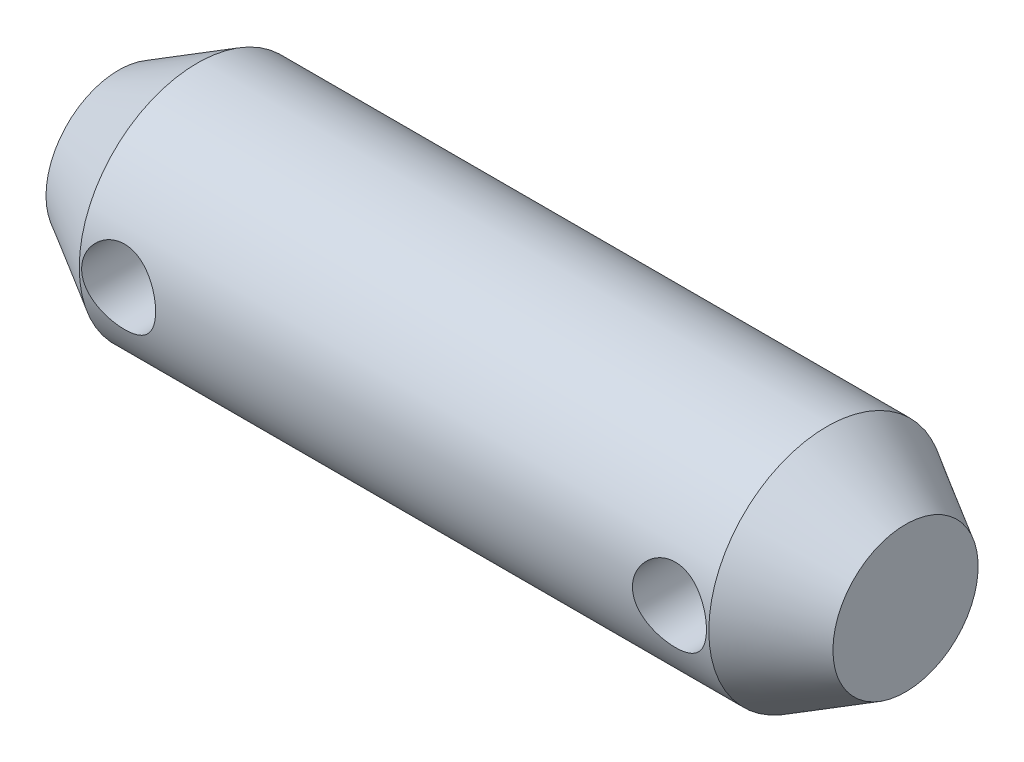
ISO-10303-21;
HEADER;
FILE_DESCRIPTION(('STEP AP214'),'2;1');
FILE_NAME('part.step','',(''),(''),'','','');
FILE_SCHEMA(('AUTOMOTIVE_DESIGN { 1 0 10303 214 1 1 1 1 }'));
ENDSEC;
DATA;
#1=APPLICATION_CONTEXT('core data for automotive mechanical design processes');
#2=APPLICATION_PROTOCOL_DEFINITION('international standard','automotive_design',2000,#1);
#3=PRODUCT_CONTEXT('',#1,'mechanical');
#4=PRODUCT('Part','Part','',(#3));
#5=PRODUCT_RELATED_PRODUCT_CATEGORY('part','',(#4));
#6=PRODUCT_DEFINITION_FORMATION('','',#4);
#7=PRODUCT_DEFINITION_CONTEXT('part definition',#1,'design');
#8=PRODUCT_DEFINITION('design','',#6,#7);
#9=PRODUCT_DEFINITION_SHAPE('','',#8);
#10=(LENGTH_UNIT() NAMED_UNIT(*) SI_UNIT(.MILLI.,.METRE.));
#11=(NAMED_UNIT(*) PLANE_ANGLE_UNIT() SI_UNIT($,.RADIAN.));
#12=(NAMED_UNIT(*) SI_UNIT($,.STERADIAN.) SOLID_ANGLE_UNIT());
#13=UNCERTAINTY_MEASURE_WITH_UNIT(LENGTH_MEASURE(1.E-05),#10,'distance_accuracy_value','');
#14=(GEOMETRIC_REPRESENTATION_CONTEXT(3) GLOBAL_UNCERTAINTY_ASSIGNED_CONTEXT((#13)) GLOBAL_UNIT_ASSIGNED_CONTEXT((#10,
#11,#12)) REPRESENTATION_CONTEXT('',''));
#15=CARTESIAN_POINT('',(0.,0.,0.));
#16=DIRECTION('',(0.,0.,1.));
#17=DIRECTION('',(1.,0.,0.));
#18=AXIS2_PLACEMENT_3D('',#15,#16,#17);
#19=CARTESIAN_POINT('',(0.,0.922649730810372,0.));
#20=DIRECTION('',(1.,0.,0.));
#21=DIRECTION('',(0.,0.,-1.));
#22=AXIS2_PLACEMENT_3D('',#19,#20,#21);
#23=PLANE('',#22);
#24=CARTESIAN_POINT('',(0.,0.,0.));
#25=DIRECTION('',(-1.,0.,0.));
#26=DIRECTION('',(0.,0.,1.));
#27=AXIS2_PLACEMENT_3D('',#24,#25,#26);
#28=CIRCLE('',#27,0.922649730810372);
#29=CARTESIAN_POINT('',(0.,0.,0.922649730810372));
#30=VERTEX_POINT('',#29);
#31=EDGE_CURVE('E86',#30,#30,#28,.T.);
#32=ORIENTED_EDGE('',*,*,#31,.T.);
#33=EDGE_LOOP('',(#32));
#34=FACE_BOUND('',#33,.T.);
#35=ADVANCED_FACE('F37',(#34),#23,.F.);
#36=CARTESIAN_POINT('',(1.,0.,0.));
#37=DIRECTION('',(1.,0.,0.));
#38=DIRECTION('',(0.,0.,-1.));
#39=AXIS2_PLACEMENT_3D('',#36,#37,#38);
#40=CONICAL_SURFACE('',#39,1.5,0.523598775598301);
#41=ORIENTED_EDGE('',*,*,#31,.F.);
#42=EDGE_LOOP('',(#41));
#43=FACE_BOUND('',#42,.T.);
#44=CARTESIAN_POINT('',(1.,0.,0.));
#45=DIRECTION('',(-1.,0.,0.));
#46=DIRECTION('',(0.,0.,1.));
#47=AXIS2_PLACEMENT_3D('',#44,#45,#46);
#48=CIRCLE('',#47,1.5);
#49=CARTESIAN_POINT('',(1.,0.,1.5));
#50=VERTEX_POINT('',#49);
#51=EDGE_CURVE('E89',#50,#50,#48,.T.);
#52=ORIENTED_EDGE('',*,*,#51,.T.);
#53=EDGE_LOOP('',(#52));
#54=FACE_BOUND('',#53,.T.);
#55=ADVANCED_FACE('F108',(#43,#54),#40,.T.);
#56=CARTESIAN_POINT('',(-13.7357999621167,0.,0.));
#57=DIRECTION('',(-1.,0.,0.));
#58=DIRECTION('',(0.,0.,1.));
#59=AXIS2_PLACEMENT_3D('',#56,#57,#58);
#60=CYLINDRICAL_SURFACE('',#59,1.5);
#61=CARTESIAN_POINT('',(1.97,0.,-1.5));
#62=CARTESIAN_POINT('',(1.96999984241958,0.0257296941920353,-1.49999987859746));
#63=CARTESIAN_POINT('',(1.96788022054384,0.0514610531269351,-1.4993317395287));
#64=CARTESIAN_POINT('',(1.95948010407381,0.102171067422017,-1.49673187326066));
#65=CARTESIAN_POINT('',(1.95319868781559,0.127149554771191,-1.49479986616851));
#66=CARTESIAN_POINT('',(1.93670775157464,0.175615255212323,-1.48988327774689));
#67=CARTESIAN_POINT('',(1.92650433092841,0.199104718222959,-1.48690033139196));
#68=CARTESIAN_POINT('',(1.90248503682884,0.24403930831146,-1.4801897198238));
#69=CARTESIAN_POINT('',(1.88866858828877,0.265484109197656,-1.47646193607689));
#70=CARTESIAN_POINT('',(1.85736415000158,0.306386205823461,-1.46852782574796));
#71=CARTESIAN_POINT('',(1.83978429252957,0.325771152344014,-1.46431103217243));
#72=CARTESIAN_POINT('',(1.80164765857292,0.361371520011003,-1.45593466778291));
#73=CARTESIAN_POINT('',(1.78109032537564,0.377586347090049,-1.45177510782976));
#74=CARTESIAN_POINT('',(1.73695498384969,0.406779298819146,-1.44387174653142));
#75=CARTESIAN_POINT('',(1.71331456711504,0.419666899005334,-1.44014085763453));
#76=CARTESIAN_POINT('',(1.66406613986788,0.441253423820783,-1.43367475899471));
#77=CARTESIAN_POINT('',(1.63845865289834,0.44995345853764,-1.4309392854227));
#78=CARTESIAN_POINT('',(1.58681965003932,0.462652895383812,-1.426883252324));
#79=CARTESIAN_POINT('',(1.56082440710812,0.466786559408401,-1.42552238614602));
#80=CARTESIAN_POINT('',(1.50847648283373,0.470655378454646,-1.42424999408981));
#81=CARTESIAN_POINT('',(1.48212389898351,0.47039170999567,-1.42433808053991));
#82=CARTESIAN_POINT('',(1.43092127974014,0.46557832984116,-1.4259180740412));
#83=CARTESIAN_POINT('',(1.40605316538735,0.461199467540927,-1.42735401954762));
#84=CARTESIAN_POINT('',(1.35742403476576,0.448557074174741,-1.43137699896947));
#85=CARTESIAN_POINT('',(1.33366313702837,0.440293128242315,-1.43396415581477));
#86=CARTESIAN_POINT('',(1.28751665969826,0.419994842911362,-1.44004082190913));
#87=CARTESIAN_POINT('',(1.26515636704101,0.407906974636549,-1.44354301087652));
#88=CARTESIAN_POINT('',(1.22272558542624,0.380341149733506,-1.45104934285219));
#89=CARTESIAN_POINT('',(1.20265569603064,0.364862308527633,-1.45505361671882));
#90=CARTESIAN_POINT('',(1.16440977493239,0.33011625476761,-1.4633372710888));
#91=CARTESIAN_POINT('',(1.14636250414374,0.310708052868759,-1.46762085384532));
#92=CARTESIAN_POINT('',(1.11374744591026,0.269087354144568,-1.47581884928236));
#93=CARTESIAN_POINT('',(1.09917991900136,0.246874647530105,-1.47973323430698));
#94=CARTESIAN_POINT('',(1.07384999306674,0.200026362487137,-1.48679327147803));
#95=CARTESIAN_POINT('',(1.06311845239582,0.175373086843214,-1.48993262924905));
#96=CARTESIAN_POINT('',(1.04599313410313,0.124489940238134,-1.49504344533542));
#97=CARTESIAN_POINT('',(1.03959803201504,0.0982605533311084,-1.49701526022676));
#98=CARTESIAN_POINT('',(1.03154680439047,0.046062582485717,-1.4995113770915));
#99=CARTESIAN_POINT('',(1.02971638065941,0.0201233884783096,-1.50008889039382));
#100=CARTESIAN_POINT('',(1.0303548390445,-0.0316943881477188,-1.49988879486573));
#101=CARTESIAN_POINT('',(1.03282308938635,-0.0575729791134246,-1.49911138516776));
#102=CARTESIAN_POINT('',(1.04184898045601,-0.10786167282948,-1.49632376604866));
#103=CARTESIAN_POINT('',(1.04830278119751,-0.132292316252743,-1.49434488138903));
#104=CARTESIAN_POINT('',(1.0649897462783,-0.179717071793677,-1.48938602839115));
#105=CARTESIAN_POINT('',(1.07522337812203,-0.202711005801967,-1.48640593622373));
#106=CARTESIAN_POINT('',(1.09945926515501,-0.247235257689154,-1.47966025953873));
#107=CARTESIAN_POINT('',(1.1135475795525,-0.268716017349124,-1.4758772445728));
#108=CARTESIAN_POINT('',(1.14498975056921,-0.309066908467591,-1.46795816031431));
#109=CARTESIAN_POINT('',(1.16234449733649,-0.327936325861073,-1.46382199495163));
#110=CARTESIAN_POINT('',(1.20064671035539,-0.363309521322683,-1.45545526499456));
#111=CARTESIAN_POINT('',(1.2217097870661,-0.379689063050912,-1.45122750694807));
#112=CARTESIAN_POINT('',(1.26637744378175,-0.408692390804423,-1.44332853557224));
#113=CARTESIAN_POINT('',(1.28998198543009,-0.421316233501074,-1.43965731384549));
#114=CARTESIAN_POINT('',(1.33901578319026,-0.442371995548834,-1.43332765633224));
#115=CARTESIAN_POINT('',(1.364437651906,-0.450819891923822,-1.43066536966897));
#116=CARTESIAN_POINT('',(1.41644365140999,-0.46328458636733,-1.42667832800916));
#117=CARTESIAN_POINT('',(1.44302733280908,-0.467303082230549,-1.42535306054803));
#118=CARTESIAN_POINT('',(1.49530302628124,-0.470672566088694,-1.42424370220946));
#119=CARTESIAN_POINT('',(1.52098062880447,-0.470227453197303,-1.42439228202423));
#120=CARTESIAN_POINT('',(1.5718759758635,-0.465174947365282,-1.42605020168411));
#121=CARTESIAN_POINT('',(1.5970937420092,-0.460567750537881,-1.42755947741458));
#122=CARTESIAN_POINT('',(1.6459868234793,-0.447458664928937,-1.43172156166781));
#123=CARTESIAN_POINT('',(1.66967944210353,-0.439015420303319,-1.43435711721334));
#124=CARTESIAN_POINT('',(1.71533064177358,-0.418520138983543,-1.44047031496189));
#125=CARTESIAN_POINT('',(1.73728886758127,-0.406467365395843,-1.44394812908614));
#126=CARTESIAN_POINT('',(1.77978222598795,-0.378541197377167,-1.45152451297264));
#127=CARTESIAN_POINT('',(1.80022750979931,-0.362536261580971,-1.45564210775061));
#128=CARTESIAN_POINT('',(1.83820815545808,-0.32739119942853,-1.46394692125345));
#129=CARTESIAN_POINT('',(1.85574273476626,-0.308250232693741,-1.46813415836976));
#130=CARTESIAN_POINT('',(1.88798171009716,-0.266619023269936,-1.4762716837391));
#131=CARTESIAN_POINT('',(1.90257405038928,-0.244039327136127,-1.48020964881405));
#132=CARTESIAN_POINT('',(1.92773659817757,-0.196624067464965,-1.48724983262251));
#133=CARTESIAN_POINT('',(1.93830836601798,-0.171789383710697,-1.49035237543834));
#134=CARTESIAN_POINT('',(1.95437431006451,-0.122697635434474,-1.49515962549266));
#135=CARTESIAN_POINT('',(1.96021699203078,-0.0985636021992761,-1.49695895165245));
#136=CARTESIAN_POINT('',(1.96802951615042,-0.0496201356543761,-1.4993790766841));
#137=CARTESIAN_POINT('',(1.97000015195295,-0.0248108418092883,-1.50000011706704));
#138=CARTESIAN_POINT('',(1.97,0.,-1.5));
#139=B_SPLINE_CURVE_WITH_KNOTS('',3,(#61,#62,#63,#64,#65,#66,#67,#68,#69,#70,#71,#72,#73,#74,
#75,#76,#77,#78,#79,#80,#81,#82,#83,#84,#85,#86,#87,#88,#89,#90,#91,#92,#93,#94,#95,#96,#97,#98,
#99,#100,#101,#102,#103,#104,#105,#106,#107,#108,#109,#110,#111,#112,#113,#114,#115,#116,#117,
#118,#119,#120,#121,#122,#123,#124,#125,#126,#127,#128,#129,#130,#131,#132,#133,#134,#135,#136,
#137,#138),.UNSPECIFIED.,.T.,.F.,(4,2,2,2,2,2,2,2,2,2,2,2,2,2,2,2,2,2,2,2,2,2,2,2,2,2,2,2,2,2,2,
2,2,2,2,2,2,2,4),(0.,0.0770978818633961,0.154212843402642,0.231208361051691,0.308216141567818,
0.38737739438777,0.466553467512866,0.547698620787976,0.628822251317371,0.707491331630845,
0.786139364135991,0.86165999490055,0.937188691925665,1.0138253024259,1.09048192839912,
1.17064784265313,1.25081975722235,1.3316228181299,1.41240118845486,1.49004434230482,
1.56767608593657,1.64336588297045,1.719065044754,1.79661583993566,1.87418779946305,
1.95485101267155,2.03551300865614,2.11586395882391,2.19618409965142,2.2728525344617,
2.34951735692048,2.42504766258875,2.50059339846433,2.57910824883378,2.65764417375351,
2.73876320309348,2.81985071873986,2.89421054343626,2.96855512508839),.UNSPECIFIED.);
#140=CARTESIAN_POINT('',(1.97,0.,-1.5));
#141=VERTEX_POINT('',#140);
#142=EDGE_CURVE('E10',#141,#141,#139,.T.);
#143=ORIENTED_EDGE('',*,*,#142,.T.);
#144=EDGE_LOOP('',(#143));
#145=FACE_BOUND('',#144,.T.);
#146=CARTESIAN_POINT('',(1.97,0.,1.5));
#147=CARTESIAN_POINT('',(1.96999984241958,-0.0257296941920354,1.49999987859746));
#148=CARTESIAN_POINT('',(1.96788022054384,-0.0514610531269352,1.4993317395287));
#149=CARTESIAN_POINT('',(1.95948010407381,-0.102171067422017,1.49673187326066));
#150=CARTESIAN_POINT('',(1.95319868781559,-0.127149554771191,1.49479986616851));
#151=CARTESIAN_POINT('',(1.93670775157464,-0.175615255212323,1.48988327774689));
#152=CARTESIAN_POINT('',(1.92650433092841,-0.199104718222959,1.48690033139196));
#153=CARTESIAN_POINT('',(1.90248503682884,-0.24403930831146,1.4801897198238));
#154=CARTESIAN_POINT('',(1.88866858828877,-0.265484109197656,1.47646193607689));
#155=CARTESIAN_POINT('',(1.85736415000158,-0.306386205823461,1.46852782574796));
#156=CARTESIAN_POINT('',(1.83978429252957,-0.325771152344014,1.46431103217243));
#157=CARTESIAN_POINT('',(1.80164765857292,-0.361371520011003,1.45593466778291));
#158=CARTESIAN_POINT('',(1.78109032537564,-0.377586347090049,1.45177510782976));
#159=CARTESIAN_POINT('',(1.73695498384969,-0.406779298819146,1.44387174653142));
#160=CARTESIAN_POINT('',(1.71331456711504,-0.419666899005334,1.44014085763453));
#161=CARTESIAN_POINT('',(1.66406613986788,-0.441253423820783,1.43367475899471));
#162=CARTESIAN_POINT('',(1.63845865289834,-0.44995345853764,1.4309392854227));
#163=CARTESIAN_POINT('',(1.58681965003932,-0.462652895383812,1.426883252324));
#164=CARTESIAN_POINT('',(1.56082440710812,-0.466786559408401,1.42552238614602));
#165=CARTESIAN_POINT('',(1.50847648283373,-0.470655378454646,1.42424999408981));
#166=CARTESIAN_POINT('',(1.48212389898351,-0.47039170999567,1.42433808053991));
#167=CARTESIAN_POINT('',(1.43092127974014,-0.46557832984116,1.4259180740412));
#168=CARTESIAN_POINT('',(1.40605316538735,-0.461199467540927,1.42735401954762));
#169=CARTESIAN_POINT('',(1.35742403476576,-0.448557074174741,1.43137699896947));
#170=CARTESIAN_POINT('',(1.33366313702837,-0.440293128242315,1.43396415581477));
#171=CARTESIAN_POINT('',(1.28751665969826,-0.419994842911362,1.44004082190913));
#172=CARTESIAN_POINT('',(1.26515636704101,-0.407906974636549,1.44354301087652));
#173=CARTESIAN_POINT('',(1.22272558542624,-0.380341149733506,1.45104934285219));
#174=CARTESIAN_POINT('',(1.20265569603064,-0.364862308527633,1.45505361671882));
#175=CARTESIAN_POINT('',(1.16440977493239,-0.33011625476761,1.4633372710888));
#176=CARTESIAN_POINT('',(1.14636250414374,-0.310708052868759,1.46762085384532));
#177=CARTESIAN_POINT('',(1.11374744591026,-0.269087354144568,1.47581884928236));
#178=CARTESIAN_POINT('',(1.09917991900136,-0.246874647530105,1.47973323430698));
#179=CARTESIAN_POINT('',(1.07384999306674,-0.200026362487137,1.48679327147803));
#180=CARTESIAN_POINT('',(1.06311845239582,-0.175373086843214,1.48993262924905));
#181=CARTESIAN_POINT('',(1.04599313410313,-0.124489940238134,1.49504344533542));
#182=CARTESIAN_POINT('',(1.03959803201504,-0.0982605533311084,1.49701526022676));
#183=CARTESIAN_POINT('',(1.03154680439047,-0.046062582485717,1.4995113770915));
#184=CARTESIAN_POINT('',(1.02971638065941,-0.0201233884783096,1.50008889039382));
#185=CARTESIAN_POINT('',(1.0303548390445,0.0316943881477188,1.49988879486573));
#186=CARTESIAN_POINT('',(1.03282308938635,0.0575729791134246,1.49911138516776));
#187=CARTESIAN_POINT('',(1.04184898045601,0.10786167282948,1.49632376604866));
#188=CARTESIAN_POINT('',(1.04830278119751,0.132292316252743,1.49434488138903));
#189=CARTESIAN_POINT('',(1.0649897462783,0.179717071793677,1.48938602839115));
#190=CARTESIAN_POINT('',(1.07522337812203,0.202711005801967,1.48640593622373));
#191=CARTESIAN_POINT('',(1.09945926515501,0.247235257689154,1.47966025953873));
#192=CARTESIAN_POINT('',(1.1135475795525,0.268716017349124,1.4758772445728));
#193=CARTESIAN_POINT('',(1.14498975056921,0.309066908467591,1.46795816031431));
#194=CARTESIAN_POINT('',(1.16234449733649,0.327936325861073,1.46382199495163));
#195=CARTESIAN_POINT('',(1.20064671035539,0.363309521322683,1.45545526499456));
#196=CARTESIAN_POINT('',(1.2217097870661,0.379689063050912,1.45122750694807));
#197=CARTESIAN_POINT('',(1.26637744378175,0.408692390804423,1.44332853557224));
#198=CARTESIAN_POINT('',(1.28998198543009,0.421316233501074,1.43965731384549));
#199=CARTESIAN_POINT('',(1.33901578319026,0.442371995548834,1.43332765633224));
#200=CARTESIAN_POINT('',(1.364437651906,0.450819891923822,1.43066536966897));
#201=CARTESIAN_POINT('',(1.41644365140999,0.46328458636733,1.42667832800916));
#202=CARTESIAN_POINT('',(1.44302733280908,0.467303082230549,1.42535306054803));
#203=CARTESIAN_POINT('',(1.49530302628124,0.470672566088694,1.42424370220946));
#204=CARTESIAN_POINT('',(1.52098062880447,0.470227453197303,1.42439228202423));
#205=CARTESIAN_POINT('',(1.5718759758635,0.465174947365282,1.42605020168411));
#206=CARTESIAN_POINT('',(1.5970937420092,0.460567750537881,1.42755947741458));
#207=CARTESIAN_POINT('',(1.6459868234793,0.447458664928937,1.43172156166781));
#208=CARTESIAN_POINT('',(1.66967944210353,0.439015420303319,1.43435711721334));
#209=CARTESIAN_POINT('',(1.71533064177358,0.418520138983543,1.44047031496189));
#210=CARTESIAN_POINT('',(1.73728886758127,0.406467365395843,1.44394812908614));
#211=CARTESIAN_POINT('',(1.77978222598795,0.378541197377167,1.45152451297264));
#212=CARTESIAN_POINT('',(1.80022750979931,0.362536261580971,1.45564210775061));
#213=CARTESIAN_POINT('',(1.83820815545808,0.32739119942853,1.46394692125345));
#214=CARTESIAN_POINT('',(1.85574273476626,0.308250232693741,1.46813415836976));
#215=CARTESIAN_POINT('',(1.88798171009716,0.266619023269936,1.4762716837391));
#216=CARTESIAN_POINT('',(1.90257405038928,0.244039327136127,1.48020964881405));
#217=CARTESIAN_POINT('',(1.92773659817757,0.196624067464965,1.48724983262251));
#218=CARTESIAN_POINT('',(1.93830836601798,0.171789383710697,1.49035237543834));
#219=CARTESIAN_POINT('',(1.95437431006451,0.122697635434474,1.49515962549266));
#220=CARTESIAN_POINT('',(1.96021699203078,0.0985636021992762,1.49695895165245));
#221=CARTESIAN_POINT('',(1.96802951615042,0.0496201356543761,1.4993790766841));
#222=CARTESIAN_POINT('',(1.97000015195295,0.0248108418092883,1.50000011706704));
#223=CARTESIAN_POINT('',(1.97,0.,1.5));
#224=B_SPLINE_CURVE_WITH_KNOTS('',3,(#146,#147,#148,#149,#150,#151,#152,#153,#154,#155,#156,
#157,#158,#159,#160,#161,#162,#163,#164,#165,#166,#167,#168,#169,#170,#171,#172,#173,#174,#175,
#176,#177,#178,#179,#180,#181,#182,#183,#184,#185,#186,#187,#188,#189,#190,#191,#192,#193,#194,
#195,#196,#197,#198,#199,#200,#201,#202,#203,#204,#205,#206,#207,#208,#209,#210,#211,#212,#213,
#214,#215,#216,#217,#218,#219,#220,#221,#222,#223),.UNSPECIFIED.,.T.,.F.,(4,2,2,2,2,2,2,2,2,2,2,
2,2,2,2,2,2,2,2,2,2,2,2,2,2,2,2,2,2,2,2,2,2,2,2,2,2,2,4),(0.,0.0770978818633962,
0.154212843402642,0.231208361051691,0.308216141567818,0.38737739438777,0.466553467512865,
0.547698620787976,0.628822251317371,0.707491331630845,0.786139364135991,0.86165999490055,
0.937188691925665,1.0138253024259,1.09048192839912,1.17064784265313,1.25081975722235,
1.3316228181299,1.41240118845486,1.49004434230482,1.56767608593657,1.64336588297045,
1.719065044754,1.79661583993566,1.87418779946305,1.95485101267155,2.03551300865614,
2.11586395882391,2.19618409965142,2.2728525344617,2.34951735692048,2.42504766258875,
2.50059339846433,2.57910824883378,2.65764417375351,2.73876320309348,2.81985071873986,
2.89421054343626,2.96855512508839),.UNSPECIFIED.);
#225=CARTESIAN_POINT('',(1.97,0.,1.5));
#226=VERTEX_POINT('',#225);
#227=EDGE_CURVE('E48',#226,#226,#224,.T.);
#228=ORIENTED_EDGE('',*,*,#227,.T.);
#229=EDGE_LOOP('',(#228));
#230=FACE_BOUND('',#229,.T.);
#231=CARTESIAN_POINT('',(8.97,0.,-1.5));
#232=CARTESIAN_POINT('',(8.96999984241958,0.0257296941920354,-1.49999987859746));
#233=CARTESIAN_POINT('',(8.96788022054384,0.0514610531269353,-1.4993317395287));
#234=CARTESIAN_POINT('',(8.95948010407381,0.102171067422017,-1.49673187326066));
#235=CARTESIAN_POINT('',(8.95319868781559,0.127149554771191,-1.49479986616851));
#236=CARTESIAN_POINT('',(8.93670775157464,0.175615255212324,-1.48988327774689));
#237=CARTESIAN_POINT('',(8.92650433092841,0.199104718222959,-1.48690033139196));
#238=CARTESIAN_POINT('',(8.90248503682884,0.24403930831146,-1.4801897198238));
#239=CARTESIAN_POINT('',(8.88866858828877,0.265484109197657,-1.47646193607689));
#240=CARTESIAN_POINT('',(8.85736415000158,0.306386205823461,-1.46852782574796));
#241=CARTESIAN_POINT('',(8.83978429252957,0.325771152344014,-1.46431103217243));
#242=CARTESIAN_POINT('',(8.80164765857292,0.361371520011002,-1.45593466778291));
#243=CARTESIAN_POINT('',(8.78109032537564,0.377586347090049,-1.45177510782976));
#244=CARTESIAN_POINT('',(8.73695498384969,0.406779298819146,-1.44387174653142));
#245=CARTESIAN_POINT('',(8.71331456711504,0.419666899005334,-1.44014085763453));
#246=CARTESIAN_POINT('',(8.66406613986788,0.441253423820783,-1.43367475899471));
#247=CARTESIAN_POINT('',(8.63845865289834,0.449953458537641,-1.4309392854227));
#248=CARTESIAN_POINT('',(8.58681965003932,0.462652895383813,-1.426883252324));
#249=CARTESIAN_POINT('',(8.56082440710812,0.466786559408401,-1.42552238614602));
#250=CARTESIAN_POINT('',(8.50847648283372,0.470655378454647,-1.42424999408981));
#251=CARTESIAN_POINT('',(8.48212389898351,0.47039170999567,-1.42433808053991));
#252=CARTESIAN_POINT('',(8.43092127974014,0.46557832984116,-1.4259180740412));
#253=CARTESIAN_POINT('',(8.40605316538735,0.461199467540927,-1.42735401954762));
#254=CARTESIAN_POINT('',(8.35742403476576,0.448557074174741,-1.43137699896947));
#255=CARTESIAN_POINT('',(8.33366313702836,0.440293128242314,-1.43396415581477));
#256=CARTESIAN_POINT('',(8.28751665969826,0.419994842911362,-1.44004082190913));
#257=CARTESIAN_POINT('',(8.26515636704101,0.407906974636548,-1.44354301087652));
#258=CARTESIAN_POINT('',(8.22272558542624,0.380341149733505,-1.45104934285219));
#259=CARTESIAN_POINT('',(8.20265569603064,0.364862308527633,-1.45505361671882));
#260=CARTESIAN_POINT('',(8.16440977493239,0.330116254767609,-1.4633372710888));
#261=CARTESIAN_POINT('',(8.14636250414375,0.310708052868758,-1.46762085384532));
#262=CARTESIAN_POINT('',(8.11374744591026,0.269087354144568,-1.47581884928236));
#263=CARTESIAN_POINT('',(8.09917991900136,0.246874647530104,-1.47973323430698));
#264=CARTESIAN_POINT('',(8.07384999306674,0.200026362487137,-1.48679327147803));
#265=CARTESIAN_POINT('',(8.06311845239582,0.175373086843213,-1.48993262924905));
#266=CARTESIAN_POINT('',(8.04599313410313,0.124489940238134,-1.49504344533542));
#267=CARTESIAN_POINT('',(8.03959803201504,0.0982605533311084,-1.49701526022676));
#268=CARTESIAN_POINT('',(8.03154680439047,0.0460625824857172,-1.4995113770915));
#269=CARTESIAN_POINT('',(8.02971638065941,0.0201233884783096,-1.50008889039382));
#270=CARTESIAN_POINT('',(8.0303548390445,-0.031694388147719,-1.49988879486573));
#271=CARTESIAN_POINT('',(8.03282308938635,-0.0575729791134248,-1.49911138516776));
#272=CARTESIAN_POINT('',(8.04184898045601,-0.10786167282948,-1.49632376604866));
#273=CARTESIAN_POINT('',(8.04830278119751,-0.132292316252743,-1.49434488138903));
#274=CARTESIAN_POINT('',(8.0649897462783,-0.179717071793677,-1.48938602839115));
#275=CARTESIAN_POINT('',(8.07522337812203,-0.202711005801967,-1.48640593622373));
#276=CARTESIAN_POINT('',(8.09945926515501,-0.247235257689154,-1.47966025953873));
#277=CARTESIAN_POINT('',(8.11354757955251,-0.268716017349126,-1.4758772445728));
#278=CARTESIAN_POINT('',(8.14498975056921,-0.309066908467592,-1.46795816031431));
#279=CARTESIAN_POINT('',(8.16234449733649,-0.327936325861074,-1.46382199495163));
#280=CARTESIAN_POINT('',(8.20064671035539,-0.363309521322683,-1.45545526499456));
#281=CARTESIAN_POINT('',(8.2217097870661,-0.379689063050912,-1.45122750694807));
#282=CARTESIAN_POINT('',(8.26637744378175,-0.408692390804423,-1.44332853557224));
#283=CARTESIAN_POINT('',(8.28998198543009,-0.421316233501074,-1.43965731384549));
#284=CARTESIAN_POINT('',(8.33901578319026,-0.442371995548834,-1.43332765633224));
#285=CARTESIAN_POINT('',(8.364437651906,-0.450819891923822,-1.43066536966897));
#286=CARTESIAN_POINT('',(8.41644365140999,-0.46328458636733,-1.42667832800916));
#287=CARTESIAN_POINT('',(8.44302733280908,-0.46730308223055,-1.42535306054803));
#288=CARTESIAN_POINT('',(8.49530302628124,-0.470672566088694,-1.42424370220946));
#289=CARTESIAN_POINT('',(8.52098062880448,-0.470227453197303,-1.42439228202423));
#290=CARTESIAN_POINT('',(8.5718759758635,-0.465174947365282,-1.42605020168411));
#291=CARTESIAN_POINT('',(8.5970937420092,-0.460567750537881,-1.42755947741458));
#292=CARTESIAN_POINT('',(8.6459868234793,-0.447458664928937,-1.43172156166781));
#293=CARTESIAN_POINT('',(8.66967944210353,-0.439015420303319,-1.43435711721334));
#294=CARTESIAN_POINT('',(8.71533064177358,-0.418520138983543,-1.44047031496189));
#295=CARTESIAN_POINT('',(8.73728886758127,-0.406467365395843,-1.44394812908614));
#296=CARTESIAN_POINT('',(8.77978222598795,-0.378541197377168,-1.45152451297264));
#297=CARTESIAN_POINT('',(8.80022750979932,-0.362536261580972,-1.45564210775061));
#298=CARTESIAN_POINT('',(8.83820815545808,-0.32739119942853,-1.46394692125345));
#299=CARTESIAN_POINT('',(8.85574273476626,-0.308250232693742,-1.46813415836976));
#300=CARTESIAN_POINT('',(8.88798171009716,-0.266619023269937,-1.4762716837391));
#301=CARTESIAN_POINT('',(8.90257405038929,-0.244039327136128,-1.48020964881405));
#302=CARTESIAN_POINT('',(8.92773659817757,-0.196624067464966,-1.48724983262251));
#303=CARTESIAN_POINT('',(8.93830836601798,-0.171789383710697,-1.49035237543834));
#304=CARTESIAN_POINT('',(8.95437431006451,-0.122697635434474,-1.49515962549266));
#305=CARTESIAN_POINT('',(8.96021699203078,-0.0985636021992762,-1.49695895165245));
#306=CARTESIAN_POINT('',(8.96802951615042,-0.0496201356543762,-1.4993790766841));
#307=CARTESIAN_POINT('',(8.97000015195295,-0.0248108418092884,-1.50000011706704));
#308=CARTESIAN_POINT('',(8.97,0.,-1.5));
#309=B_SPLINE_CURVE_WITH_KNOTS('',3,(#231,#232,#233,#234,#235,#236,#237,#238,#239,#240,#241,
#242,#243,#244,#245,#246,#247,#248,#249,#250,#251,#252,#253,#254,#255,#256,#257,#258,#259,#260,
#261,#262,#263,#264,#265,#266,#267,#268,#269,#270,#271,#272,#273,#274,#275,#276,#277,#278,#279,
#280,#281,#282,#283,#284,#285,#286,#287,#288,#289,#290,#291,#292,#293,#294,#295,#296,#297,#298,
#299,#300,#301,#302,#303,#304,#305,#306,#307,#308),.UNSPECIFIED.,.T.,.F.,(4,2,2,2,2,2,2,2,2,2,2,
2,2,2,2,2,2,2,2,2,2,2,2,2,2,2,2,2,2,2,2,2,2,2,2,2,2,2,4),(0.,0.0770978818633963,
0.154212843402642,0.231208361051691,0.308216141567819,0.38737739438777,0.466553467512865,
0.547698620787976,0.628822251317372,0.707491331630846,0.786139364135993,0.861659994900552,
0.937188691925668,1.0138253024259,1.09048192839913,1.17064784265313,1.25081975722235,
1.3316228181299,1.41240118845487,1.49004434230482,1.56767608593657,1.64336588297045,
1.719065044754,1.79661583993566,1.87418779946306,1.95485101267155,2.03551300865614,
2.11586395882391,2.19618409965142,2.2728525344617,2.34951735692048,2.42504766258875,
2.50059339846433,2.57910824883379,2.65764417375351,2.73876320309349,2.81985071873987,
2.89421054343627,2.96855512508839),.UNSPECIFIED.);
#310=CARTESIAN_POINT('',(8.97,0.,-1.5));
#311=VERTEX_POINT('',#310);
#312=EDGE_CURVE('E52',#311,#311,#309,.T.);
#313=ORIENTED_EDGE('',*,*,#312,.T.);
#314=EDGE_LOOP('',(#313));
#315=FACE_BOUND('',#314,.T.);
#316=CARTESIAN_POINT('',(8.97,0.,1.5));
#317=CARTESIAN_POINT('',(8.96999984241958,-0.0257296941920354,1.49999987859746));
#318=CARTESIAN_POINT('',(8.96788022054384,-0.0514610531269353,1.4993317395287));
#319=CARTESIAN_POINT('',(8.95948010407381,-0.102171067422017,1.49673187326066));
#320=CARTESIAN_POINT('',(8.95319868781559,-0.127149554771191,1.49479986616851));
#321=CARTESIAN_POINT('',(8.93670775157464,-0.175615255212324,1.48988327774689));
#322=CARTESIAN_POINT('',(8.92650433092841,-0.199104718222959,1.48690033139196));
#323=CARTESIAN_POINT('',(8.90248503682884,-0.24403930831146,1.4801897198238));
#324=CARTESIAN_POINT('',(8.88866858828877,-0.265484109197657,1.47646193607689));
#325=CARTESIAN_POINT('',(8.85736415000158,-0.306386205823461,1.46852782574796));
#326=CARTESIAN_POINT('',(8.83978429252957,-0.325771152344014,1.46431103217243));
#327=CARTESIAN_POINT('',(8.80164765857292,-0.361371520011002,1.45593466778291));
#328=CARTESIAN_POINT('',(8.78109032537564,-0.377586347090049,1.45177510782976));
#329=CARTESIAN_POINT('',(8.73695498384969,-0.406779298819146,1.44387174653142));
#330=CARTESIAN_POINT('',(8.71331456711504,-0.419666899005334,1.44014085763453));
#331=CARTESIAN_POINT('',(8.66406613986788,-0.441253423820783,1.43367475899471));
#332=CARTESIAN_POINT('',(8.63845865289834,-0.449953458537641,1.4309392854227));
#333=CARTESIAN_POINT('',(8.58681965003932,-0.462652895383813,1.426883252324));
#334=CARTESIAN_POINT('',(8.56082440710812,-0.466786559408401,1.42552238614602));
#335=CARTESIAN_POINT('',(8.50847648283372,-0.470655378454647,1.42424999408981));
#336=CARTESIAN_POINT('',(8.48212389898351,-0.47039170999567,1.42433808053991));
#337=CARTESIAN_POINT('',(8.43092127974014,-0.46557832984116,1.4259180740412));
#338=CARTESIAN_POINT('',(8.40605316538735,-0.461199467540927,1.42735401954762));
#339=CARTESIAN_POINT('',(8.35742403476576,-0.448557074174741,1.43137699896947));
#340=CARTESIAN_POINT('',(8.33366313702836,-0.440293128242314,1.43396415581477));
#341=CARTESIAN_POINT('',(8.28751665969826,-0.419994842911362,1.44004082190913));
#342=CARTESIAN_POINT('',(8.26515636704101,-0.407906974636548,1.44354301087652));
#343=CARTESIAN_POINT('',(8.22272558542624,-0.380341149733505,1.45104934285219));
#344=CARTESIAN_POINT('',(8.20265569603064,-0.364862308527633,1.45505361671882));
#345=CARTESIAN_POINT('',(8.16440977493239,-0.330116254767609,1.4633372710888));
#346=CARTESIAN_POINT('',(8.14636250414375,-0.310708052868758,1.46762085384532));
#347=CARTESIAN_POINT('',(8.11374744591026,-0.269087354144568,1.47581884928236));
#348=CARTESIAN_POINT('',(8.09917991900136,-0.246874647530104,1.47973323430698));
#349=CARTESIAN_POINT('',(8.07384999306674,-0.200026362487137,1.48679327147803));
#350=CARTESIAN_POINT('',(8.06311845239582,-0.175373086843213,1.48993262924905));
#351=CARTESIAN_POINT('',(8.04599313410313,-0.124489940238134,1.49504344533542));
#352=CARTESIAN_POINT('',(8.03959803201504,-0.0982605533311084,1.49701526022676));
#353=CARTESIAN_POINT('',(8.03154680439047,-0.0460625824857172,1.4995113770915));
#354=CARTESIAN_POINT('',(8.02971638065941,-0.0201233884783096,1.50008889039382));
#355=CARTESIAN_POINT('',(8.0303548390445,0.031694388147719,1.49988879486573));
#356=CARTESIAN_POINT('',(8.03282308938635,0.0575729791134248,1.49911138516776));
#357=CARTESIAN_POINT('',(8.04184898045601,0.10786167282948,1.49632376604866));
#358=CARTESIAN_POINT('',(8.04830278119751,0.132292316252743,1.49434488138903));
#359=CARTESIAN_POINT('',(8.0649897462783,0.179717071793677,1.48938602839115));
#360=CARTESIAN_POINT('',(8.07522337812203,0.202711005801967,1.48640593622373));
#361=CARTESIAN_POINT('',(8.09945926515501,0.247235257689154,1.47966025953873));
#362=CARTESIAN_POINT('',(8.11354757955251,0.268716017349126,1.4758772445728));
#363=CARTESIAN_POINT('',(8.14498975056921,0.309066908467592,1.46795816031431));
#364=CARTESIAN_POINT('',(8.16234449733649,0.327936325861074,1.46382199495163));
#365=CARTESIAN_POINT('',(8.20064671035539,0.363309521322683,1.45545526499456));
#366=CARTESIAN_POINT('',(8.2217097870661,0.379689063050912,1.45122750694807));
#367=CARTESIAN_POINT('',(8.26637744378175,0.408692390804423,1.44332853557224));
#368=CARTESIAN_POINT('',(8.28998198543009,0.421316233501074,1.43965731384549));
#369=CARTESIAN_POINT('',(8.33901578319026,0.442371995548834,1.43332765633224));
#370=CARTESIAN_POINT('',(8.364437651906,0.450819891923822,1.43066536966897));
#371=CARTESIAN_POINT('',(8.41644365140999,0.46328458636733,1.42667832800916));
#372=CARTESIAN_POINT('',(8.44302733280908,0.46730308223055,1.42535306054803));
#373=CARTESIAN_POINT('',(8.49530302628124,0.470672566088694,1.42424370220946));
#374=CARTESIAN_POINT('',(8.52098062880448,0.470227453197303,1.42439228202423));
#375=CARTESIAN_POINT('',(8.5718759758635,0.465174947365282,1.42605020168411));
#376=CARTESIAN_POINT('',(8.5970937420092,0.460567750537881,1.42755947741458));
#377=CARTESIAN_POINT('',(8.6459868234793,0.447458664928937,1.43172156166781));
#378=CARTESIAN_POINT('',(8.66967944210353,0.439015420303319,1.43435711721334));
#379=CARTESIAN_POINT('',(8.71533064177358,0.418520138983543,1.44047031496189));
#380=CARTESIAN_POINT('',(8.73728886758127,0.406467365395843,1.44394812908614));
#381=CARTESIAN_POINT('',(8.77978222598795,0.378541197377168,1.45152451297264));
#382=CARTESIAN_POINT('',(8.80022750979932,0.362536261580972,1.45564210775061));
#383=CARTESIAN_POINT('',(8.83820815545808,0.32739119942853,1.46394692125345));
#384=CARTESIAN_POINT('',(8.85574273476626,0.308250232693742,1.46813415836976));
#385=CARTESIAN_POINT('',(8.88798171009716,0.266619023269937,1.4762716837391));
#386=CARTESIAN_POINT('',(8.90257405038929,0.244039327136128,1.48020964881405));
#387=CARTESIAN_POINT('',(8.92773659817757,0.196624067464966,1.48724983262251));
#388=CARTESIAN_POINT('',(8.93830836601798,0.171789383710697,1.49035237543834));
#389=CARTESIAN_POINT('',(8.95437431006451,0.122697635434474,1.49515962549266));
#390=CARTESIAN_POINT('',(8.96021699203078,0.0985636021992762,1.49695895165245));
#391=CARTESIAN_POINT('',(8.96802951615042,0.0496201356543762,1.4993790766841));
#392=CARTESIAN_POINT('',(8.97000015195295,0.0248108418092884,1.50000011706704));
#393=CARTESIAN_POINT('',(8.97,0.,1.5));
#394=B_SPLINE_CURVE_WITH_KNOTS('',3,(#316,#317,#318,#319,#320,#321,#322,#323,#324,#325,#326,
#327,#328,#329,#330,#331,#332,#333,#334,#335,#336,#337,#338,#339,#340,#341,#342,#343,#344,#345,
#346,#347,#348,#349,#350,#351,#352,#353,#354,#355,#356,#357,#358,#359,#360,#361,#362,#363,#364,
#365,#366,#367,#368,#369,#370,#371,#372,#373,#374,#375,#376,#377,#378,#379,#380,#381,#382,#383,
#384,#385,#386,#387,#388,#389,#390,#391,#392,#393),.UNSPECIFIED.,.T.,.F.,(4,2,2,2,2,2,2,2,2,2,2,
2,2,2,2,2,2,2,2,2,2,2,2,2,2,2,2,2,2,2,2,2,2,2,2,2,2,2,4),(0.,0.0770978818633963,
0.154212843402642,0.231208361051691,0.308216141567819,0.38737739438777,0.466553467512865,
0.547698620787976,0.628822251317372,0.707491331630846,0.786139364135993,0.861659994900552,
0.937188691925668,1.0138253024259,1.09048192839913,1.17064784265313,1.25081975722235,
1.3316228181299,1.41240118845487,1.49004434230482,1.56767608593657,1.64336588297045,
1.719065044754,1.79661583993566,1.87418779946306,1.95485101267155,2.03551300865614,
2.11586395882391,2.19618409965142,2.2728525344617,2.34951735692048,2.42504766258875,
2.50059339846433,2.57910824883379,2.65764417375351,2.73876320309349,2.81985071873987,
2.89421054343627,2.96855512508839),.UNSPECIFIED.);
#395=CARTESIAN_POINT('',(8.97,0.,1.5));
#396=VERTEX_POINT('',#395);
#397=EDGE_CURVE('E56',#396,#396,#394,.T.);
#398=ORIENTED_EDGE('',*,*,#397,.T.);
#399=EDGE_LOOP('',(#398));
#400=FACE_BOUND('',#399,.T.);
#401=ORIENTED_EDGE('',*,*,#51,.F.);
#402=EDGE_LOOP('',(#401));
#403=FACE_BOUND('',#402,.T.);
#404=CARTESIAN_POINT('',(9.,0.,0.));
#405=DIRECTION('',(-1.,0.,0.));
#406=DIRECTION('',(0.,0.,1.));
#407=AXIS2_PLACEMENT_3D('',#404,#405,#406);
#408=CIRCLE('',#407,1.5);
#409=CARTESIAN_POINT('',(9.,0.,1.5));
#410=VERTEX_POINT('',#409);
#411=EDGE_CURVE('E92',#410,#410,#408,.T.);
#412=ORIENTED_EDGE('',*,*,#411,.T.);
#413=EDGE_LOOP('',(#412));
#414=FACE_BOUND('',#413,.T.);
#415=ADVANCED_FACE('F66',(#145,#230,#315,#400,#403,#414),#60,.T.);
#416=CARTESIAN_POINT('',(10.,0.,0.));
#417=DIRECTION('',(-1.,0.,0.));
#418=DIRECTION('',(0.,0.,1.));
#419=AXIS2_PLACEMENT_3D('',#416,#417,#418);
#420=CONICAL_SURFACE('',#419,0.922649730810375,0.523598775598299);
#421=ORIENTED_EDGE('',*,*,#411,.F.);
#422=EDGE_LOOP('',(#421));
#423=FACE_BOUND('',#422,.T.);
#424=CARTESIAN_POINT('',(10.,0.,0.));
#425=DIRECTION('',(-1.,0.,0.));
#426=DIRECTION('',(0.,0.,1.));
#427=AXIS2_PLACEMENT_3D('',#424,#425,#426);
#428=CIRCLE('',#427,0.922649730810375);
#429=CARTESIAN_POINT('',(10.,0.,0.922649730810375));
#430=VERTEX_POINT('',#429);
#431=EDGE_CURVE('E95',#430,#430,#428,.T.);
#432=ORIENTED_EDGE('',*,*,#431,.T.);
#433=EDGE_LOOP('',(#432));
#434=FACE_BOUND('',#433,.T.);
#435=ADVANCED_FACE('F99',(#423,#434),#420,.T.);
#436=CARTESIAN_POINT('',(10.,0.,0.));
#437=DIRECTION('',(-1.,0.,0.));
#438=DIRECTION('',(0.,0.,1.));
#439=AXIS2_PLACEMENT_3D('',#436,#437,#438);
#440=PLANE('',#439);
#441=ORIENTED_EDGE('',*,*,#431,.F.);
#442=EDGE_LOOP('',(#441));
#443=FACE_BOUND('',#442,.T.);
#444=ADVANCED_FACE('F78',(#443),#440,.F.);
#445=CARTESIAN_POINT('',(8.5,0.,-1.5));
#446=DIRECTION('',(0.,0.,1.));
#447=DIRECTION('',(1.,0.,0.));
#448=AXIS2_PLACEMENT_3D('',#445,#446,#447);
#449=CYLINDRICAL_SURFACE('',#448,0.47);
#450=ORIENTED_EDGE('',*,*,#312,.F.);
#451=EDGE_LOOP('',(#450));
#452=FACE_BOUND('',#451,.T.);
#453=ORIENTED_EDGE('',*,*,#397,.F.);
#454=EDGE_LOOP('',(#453));
#455=FACE_BOUND('',#454,.T.);
#456=ADVANCED_FACE('F72',(#452,#455),#449,.F.);
#457=CARTESIAN_POINT('',(1.5,0.,-1.5));
#458=DIRECTION('',(0.,0.,1.));
#459=DIRECTION('',(1.,0.,0.));
#460=AXIS2_PLACEMENT_3D('',#457,#458,#459);
#461=CYLINDRICAL_SURFACE('',#460,0.47);
#462=ORIENTED_EDGE('',*,*,#142,.F.);
#463=EDGE_LOOP('',(#462));
#464=FACE_BOUND('',#463,.T.);
#465=ORIENTED_EDGE('',*,*,#227,.F.);
#466=EDGE_LOOP('',(#465));
#467=FACE_BOUND('',#466,.T.);
#468=ADVANCED_FACE('F69',(#464,#467),#461,.F.);
#469=CLOSED_SHELL('',(#35,#55,#415,#435,#444,#456,#468));
#470=MANIFOLD_SOLID_BREP('B2',#469);
#471=ADVANCED_BREP_SHAPE_REPRESENTATION('',(#18,#470),#14);
#472=SHAPE_DEFINITION_REPRESENTATION(#9,#471);
ENDSEC;
END-ISO-10303-21;
